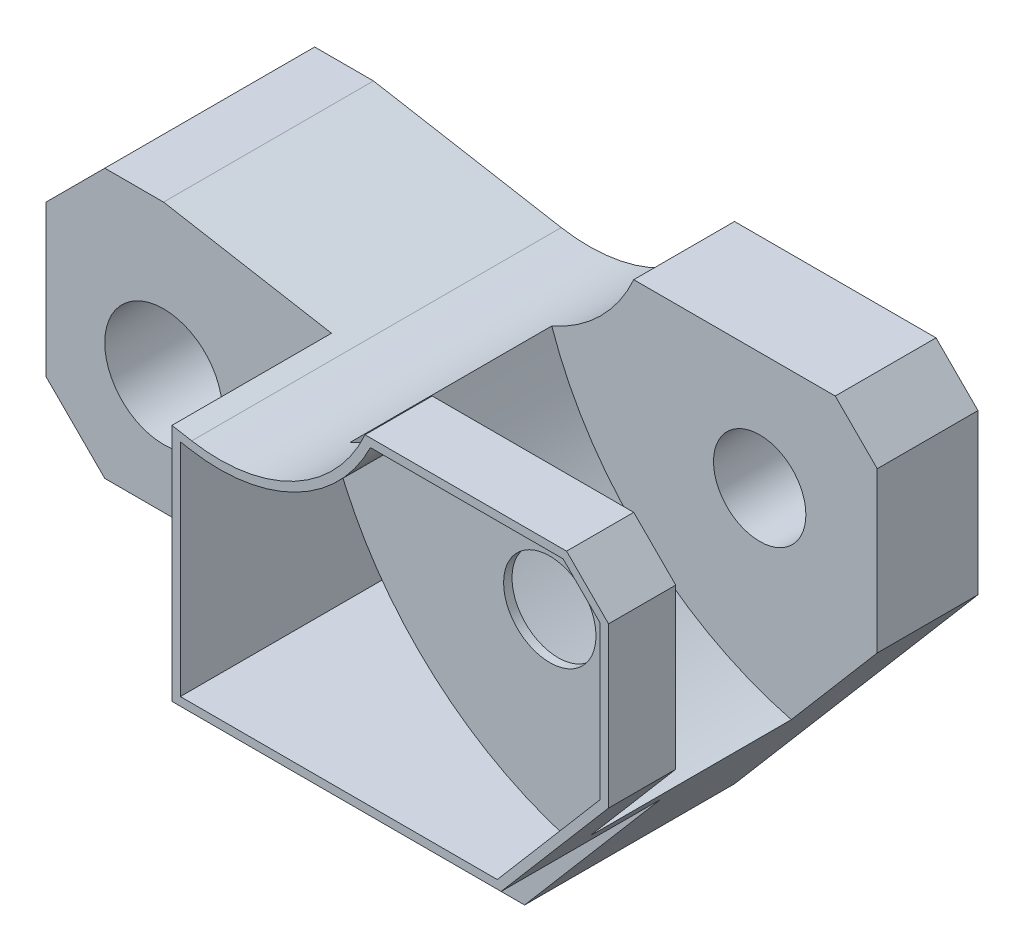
from build123d import *

# Parameters (mm, degrees)
BOSS_EXTRUDE1_DEPTH = 22
CHAMFER1_SIZE       = 7
CHAMFER2_SIZE       = 5
SKETCH2_R           = 7
CUT_EXTRUDE1_DEPTH  = 105.177732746
SKETCH3_W           = 34
SKETCH3_H           = 19
CUT_EXTRUDE2_DEPTH  = 107.037729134
CUT_EXTRUDE3_DEPTH  = 19
CUT_EXTRUDE4_START  = -24
CUT_EXTRUDE4_DEPTH  = 24
SKETCH6_R           = 5.5
CUT_EXTRUDE5_DEPTH  = 105.177732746
CUT_EXTRUDE6_DEPTH  = 32
SKETCH7_3_R         = 5.5
CUT_EXTRUDE7_DEPTH  = 7


with BuildPart() as part:
    # Sketch1 → Boss-Extrude1 (new, symmetric)
    with BuildSketch(Plane.XY):
        with BuildLine():
            Line((0, 0), (0, 32))
            Line((0, 32), (14, 32))
            Line((14, 32), (36.361380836, 28.057085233))
            ThreePointArc((36.361380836, 28.057085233), (48.561098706, 29.982044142), (57, 39))
            Line((57, 39), (86, 39))
            Line((86, 39), (86, 15))
            Line((86, 15), (57, -19))
            Line((57, -19), (51.296980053, -19))
            ThreePointArc((51.296980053, -19), (46.858007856, -12.115672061), (44.521177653, -4.264705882))
            ThreePointArc((44.521177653, -4.264705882), (42.840774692, -1.213413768), (39.575538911, 0))
            Line((39.575538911, 0), (0, 0))
        make_face()
    extrude(amount=BOSS_EXTRUDE1_DEPTH, both=True)

    # Chamfer1
    chamfer1_edges = [part.edges().sort_by_distance(p)[0] for p in [
        (0, 0, 0),
        (0, 32, 0),
    ]]
    chamfer(chamfer1_edges, length=CHAMFER1_SIZE)

    # Chamfer2
    chamfer2_edges = [part.edges().sort_by_distance(p)[0] for p in [
        (86, 39, 0),
    ]]
    chamfer(chamfer2_edges, length=CHAMFER2_SIZE)

    # Sketch2 → Cut-Extrude1 (cut, through all)
    with BuildSketch(Plane.XY.offset(22)):
        with Locations((14, 14)):
            Circle(SKETCH2_R)
    extrude(amount=-CUT_EXTRUDE1_DEPTH, mode=Mode.SUBTRACT)

    # Sketch3 → Cut-Extrude2 (cut, through all)
    with BuildSketch(Plane(origin=(0, 39, 0), x_dir=(1, 0, 0), z_dir=(0, 1, 0))):
        with Locations((17, -12.5)):
            Rectangle(SKETCH3_W, SKETCH3_H)
    extrude(amount=-CUT_EXTRUDE2_DEPTH, mode=Mode.SUBTRACT)

    # Sketch4 → Cut-Extrude3 (cut)
    with BuildSketch(Plane.XY.offset(22)):
        with BuildLine():
            Line((39.575538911, 0), (73.205882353, 0))
            Line((73.205882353, 0), (57, -19))
            Line((57, -19), (51.296980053, -19))
            ThreePointArc((51.296980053, -19), (46.858007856, -12.115672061), (44.521177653, -4.264705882))
            ThreePointArc((44.521177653, -4.264705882), (42.840774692, -1.213413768), (39.575538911, 0))
        make_face()
    extrude(amount=-CUT_EXTRUDE3_DEPTH, mode=Mode.SUBTRACT)

    # Sketch5 → Cut-Extrude4 (cut)
    with BuildSketch(Plane(origin=(0, 0, -10), x_dir=(-1, 0, 0), z_dir=(0, 0, -1)).offset(CUT_EXTRUDE4_START)):
        with BuildLine():
            Line((-75.764705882, 3), (-86, 15))
            Line((-86, 15), (-86, 34))
            Line((-86, 34), (-81, 39))
            Line((-81, 39), (-57, 39))
            ThreePointArc((-57, 39), (-53.021244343, 33.259333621), (-47.236936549, 29.344294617))
            ThreePointArc((-47.236936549, 29.344294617), (-58.184262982, 12.580705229), (-75.764705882, 3))
        make_face()
    extrude(amount=CUT_EXTRUDE4_DEPTH, mode=Mode.SUBTRACT)

    # Sketch6 → Cut-Extrude5 (cut, through all)
    with BuildSketch(Plane.XY.offset(22)):
        with Locations((72, 25)):
            Circle(SKETCH6_R)
    extrude(amount=-CUT_EXTRUDE5_DEPTH, mode=Mode.SUBTRACT)

    # Sketch7 → Cut-Extrude6 (cut)
    with BuildSketch(Plane.XY.offset(22)):
        with BuildLine():
            Line((35, 27.281706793), (35, 1))
            Line((35, 1), (72.744476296, 1))
            Line((72.744476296, 1), (73.986847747, 2.456573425))
            ThreePointArc((73.986847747, 2.456573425), (57.310181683, 12.027872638), (46.646682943, 28.028208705))
            ThreePointArc((46.646682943, 28.028208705), (41.481076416, 26.851449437), (36.187732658, 27.07227748))
            Line((36.187732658, 27.07227748), (35, 27.281706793))
        make_face()
    extrude(amount=-CUT_EXTRUDE6_DEPTH, mode=Mode.SUBTRACT)

    # Sketch7_3 → Cut-Extrude7 (cut)
    with BuildSketch(Plane.XY.offset(22)):
        with BuildLine():
            ThreePointArc((46.646682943, 28.028208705), (57.310181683, 12.027872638), (73.986847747, 2.456573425))
            Line((73.986847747, 2.456573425), (85, 15.368545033))
            Line((85, 15.368545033), (85, 33.585786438))
            Line((85, 33.585786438), (80.585786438, 38))
            Line((80.585786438, 38), (57.636084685, 38))
            ThreePointArc((57.636084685, 38), (53.100440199, 31.957177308), (46.646682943, 28.028208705))
        make_face()
        with Locations((72, 25)):
            Circle(SKETCH7_3_R, mode=Mode.SUBTRACT)
    extrude(amount=-CUT_EXTRUDE7_DEPTH, mode=Mode.SUBTRACT)


solid = part.part
